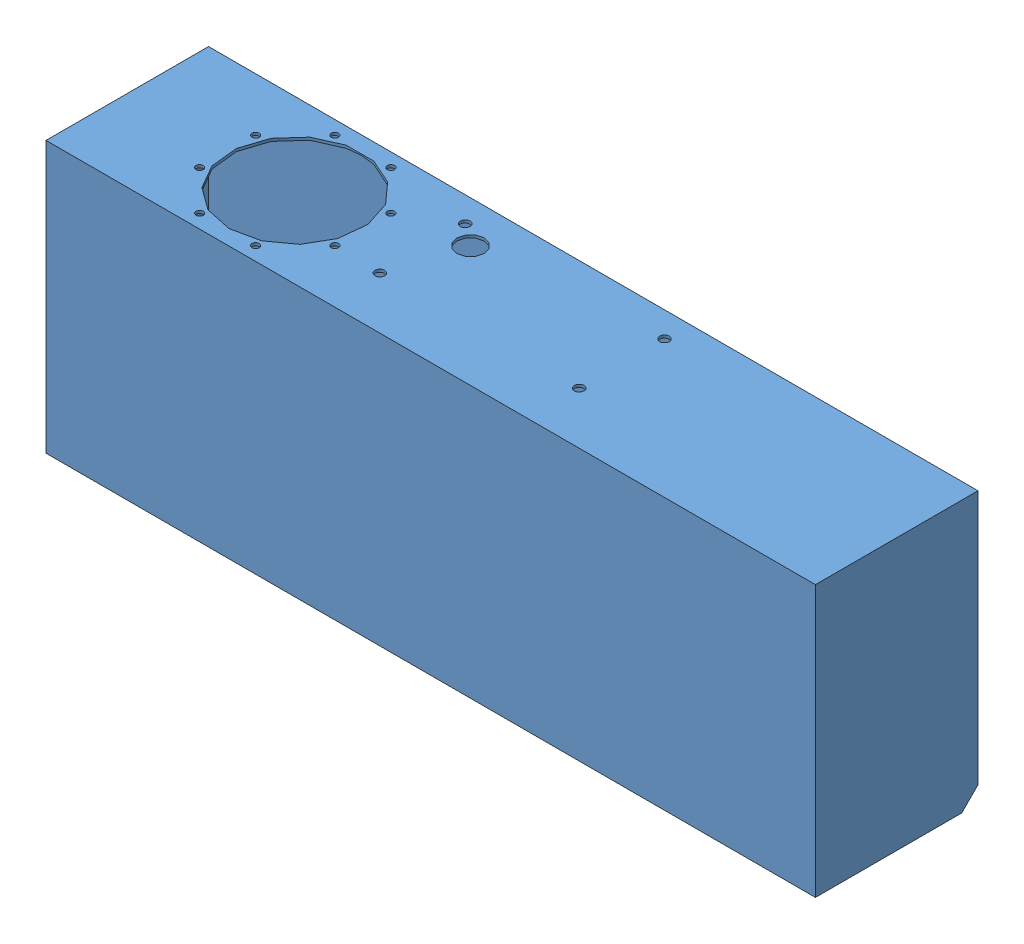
SolidWorks assembly 187 RESERVOIR.SLDASM, configuration Défaut (file format 3100). Lengths in mm.
Overall size (710 316.42 172.76).
3 component instances, 3 part files, 4 mates.
Components (placement in the parent):
- 187 A-1: 187 A.SLDPRT [Défaut] at (-374.6676 -97.1376 0) size (710 250 150)
- 187 B-1: 187 B.SLDPRT [Défaut] at (-119.6676 -157.1376 -11.641) x (0.999611 0.01395 -0.024162) z (0 0.866025 0.5) size (25 25 100)
- 187 D-1: 187 D.SLDPRT [Défaut] at (-304.6676 -122.1376 23) x (1 0 0) z (0 1 0) size (30 30 25)
Mates (geometry in assembly coordinates):
- Coaxiale1: concentric: cylinder of 187 A-1; cylinder of 187 B-1
- Distance2: distance = 60 mm: point of 187 B-1; plane of 187 A-1
- Coïncidente4: coincident: plane of 187 A-1; plane of 187 D-1
- Coaxiale2: concentric aligned: cylinder of 187 A-1; cylinder of 187 D-1
